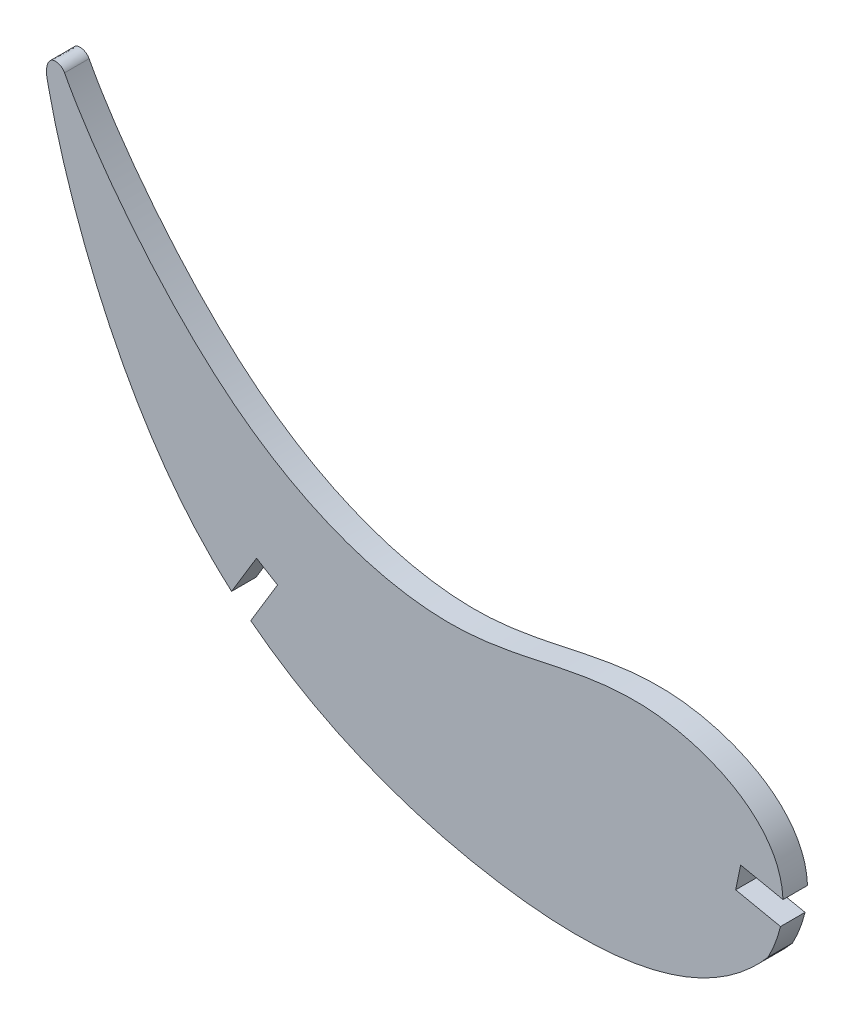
ISO-10303-21;
HEADER;
FILE_DESCRIPTION(('STEP AP214'),'2;1');
FILE_NAME('part.step','',(''),(''),'','','');
FILE_SCHEMA(('AUTOMOTIVE_DESIGN { 1 0 10303 214 1 1 1 1 }'));
ENDSEC;
DATA;
#1=APPLICATION_CONTEXT('core data for automotive mechanical design processes');
#2=APPLICATION_PROTOCOL_DEFINITION('international standard','automotive_design',2000,#1);
#3=PRODUCT_CONTEXT('',#1,'mechanical');
#4=PRODUCT('Part','Part','',(#3));
#5=PRODUCT_RELATED_PRODUCT_CATEGORY('part','',(#4));
#6=PRODUCT_DEFINITION_FORMATION('','',#4);
#7=PRODUCT_DEFINITION_CONTEXT('part definition',#1,'design');
#8=PRODUCT_DEFINITION('design','',#6,#7);
#9=PRODUCT_DEFINITION_SHAPE('','',#8);
#10=(LENGTH_UNIT() NAMED_UNIT(*) SI_UNIT(.MILLI.,.METRE.));
#11=(NAMED_UNIT(*) PLANE_ANGLE_UNIT() SI_UNIT($,.RADIAN.));
#12=(NAMED_UNIT(*) SI_UNIT($,.STERADIAN.) SOLID_ANGLE_UNIT());
#13=UNCERTAINTY_MEASURE_WITH_UNIT(LENGTH_MEASURE(1.E-05),#10,'distance_accuracy_value','');
#14=(GEOMETRIC_REPRESENTATION_CONTEXT(3) GLOBAL_UNCERTAINTY_ASSIGNED_CONTEXT((#13)) GLOBAL_UNIT_ASSIGNED_CONTEXT((#10,
#11,#12)) REPRESENTATION_CONTEXT('',''));
#15=CARTESIAN_POINT('',(0.,0.,0.));
#16=DIRECTION('',(0.,0.,1.));
#17=DIRECTION('',(1.,0.,0.));
#18=AXIS2_PLACEMENT_3D('',#15,#16,#17);
#19=CARTESIAN_POINT('',(-35.7383623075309,6.16804112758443,1.5875));
#20=DIRECTION('',(0.517983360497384,0.855390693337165,0.));
#21=DIRECTION('',(-0.855390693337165,0.517983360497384,0.));
#22=AXIS2_PLACEMENT_3D('',#19,#20,#21);
#23=PLANE('',#22);
#24=DIRECTION('',(0.855390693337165,-0.517983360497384,0.));
#25=VECTOR('',#24,1.);
#26=CARTESIAN_POINT('',(-35.7383623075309,6.16804112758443,-1.5875));
#27=LINE('',#26,#25);
#28=CARTESIAN_POINT('',(-35.7383623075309,6.16804112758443,-1.5875));
#29=VERTEX_POINT('',#28);
#30=CARTESIAN_POINT('',(-33.0224974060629,4.52344429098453,-1.5875));
#31=VERTEX_POINT('',#30);
#32=EDGE_CURVE('E219',#29,#31,#27,.T.);
#33=ORIENTED_EDGE('',*,*,#32,.T.);
#34=DIRECTION('',(0.,0.,-1.));
#35=VECTOR('',#34,1.);
#36=CARTESIAN_POINT('',(-33.0224974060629,4.52344429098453,1.5875));
#37=LINE('',#36,#35);
#38=CARTESIAN_POINT('',(-33.0224974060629,4.52344429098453,1.5875));
#39=VERTEX_POINT('',#38);
#40=EDGE_CURVE('E11',#39,#31,#37,.T.);
#41=ORIENTED_EDGE('',*,*,#40,.F.);
#42=DIRECTION('',(0.855390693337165,-0.517983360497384,0.));
#43=VECTOR('',#42,1.);
#44=CARTESIAN_POINT('',(-35.7383623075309,6.16804112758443,1.5875));
#45=LINE('',#44,#43);
#46=CARTESIAN_POINT('',(-35.7383623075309,6.16804112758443,1.5875));
#47=VERTEX_POINT('',#46);
#48=EDGE_CURVE('E267',#47,#39,#45,.T.);
#49=ORIENTED_EDGE('',*,*,#48,.F.);
#50=DIRECTION('',(0.,0.,-1.));
#51=VECTOR('',#50,1.);
#52=CARTESIAN_POINT('',(-35.7383623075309,6.16804112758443,1.5875));
#53=LINE('',#52,#51);
#54=EDGE_CURVE('E141',#47,#29,#53,.T.);
#55=ORIENTED_EDGE('',*,*,#54,.T.);
#56=EDGE_LOOP('',(#33,#41,#49,#55));
#57=FACE_BOUND('',#56,.T.);
#58=ADVANCED_FACE('F31',(#57),#23,.F.);
#59=CARTESIAN_POINT('',(-33.0224974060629,4.52344429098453,1.5875));
#60=DIRECTION('',(0.855390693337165,-0.517983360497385,0.));
#61=DIRECTION('',(0.517983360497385,0.855390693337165,0.));
#62=AXIS2_PLACEMENT_3D('',#59,#60,#61);
#63=PLANE('',#62);
#64=DIRECTION('',(-0.517983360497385,-0.855390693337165,0.));
#65=VECTOR('',#64,1.);
#66=CARTESIAN_POINT('',(-33.0224974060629,4.52344429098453,-1.5875));
#67=LINE('',#66,#65);
#68=CARTESIAN_POINT('',(-36.4917249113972,-1.20559093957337,-1.5875));
#69=VERTEX_POINT('',#68);
#70=EDGE_CURVE('E210',#31,#69,#67,.T.);
#71=ORIENTED_EDGE('',*,*,#70,.T.);
#72=DIRECTION('',(0.,0.,-1.));
#73=VECTOR('',#72,1.);
#74=CARTESIAN_POINT('',(-36.4917249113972,-1.20559093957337,1.5875));
#75=LINE('',#74,#73);
#76=CARTESIAN_POINT('',(-36.4917249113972,-1.20559093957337,1.5875));
#77=VERTEX_POINT('',#76);
#78=EDGE_CURVE('E39',#77,#69,#75,.T.);
#79=ORIENTED_EDGE('',*,*,#78,.F.);
#80=DIRECTION('',(-0.517983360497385,-0.855390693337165,0.));
#81=VECTOR('',#80,1.);
#82=CARTESIAN_POINT('',(-33.0224974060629,4.52344429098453,1.5875));
#83=LINE('',#82,#81);
#84=EDGE_CURVE('E99',#39,#77,#83,.T.);
#85=ORIENTED_EDGE('',*,*,#84,.F.);
#86=ORIENTED_EDGE('',*,*,#40,.T.);
#87=EDGE_LOOP('',(#71,#79,#85,#86));
#88=FACE_BOUND('',#87,.T.);
#89=ADVANCED_FACE('F202',(#88),#63,.F.);
#90=CARTESIAN_POINT('',(-36.4917249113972,-1.20559093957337,1.5875));
#91=CARTESIAN_POINT('',(-26.6748991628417,-8.85773970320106,1.5875));
#92=CARTESIAN_POINT('',(0.160896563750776,-18.099053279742,1.5875));
#93=CARTESIAN_POINT('',(22.4883842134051,-14.7973970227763,1.5875));
#94=CARTESIAN_POINT('',(30.4569142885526,-5.46608523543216,1.5875));
#95=B_SPLINE_CURVE_WITH_KNOTS('',3,(#90,#91,#92,#93,#94),.UNSPECIFIED.,.F.,.F.,(4,1,4),
(27.4766594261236,28.2773447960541,29.2773447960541),.UNSPECIFIED.);
#96=DIRECTION('',(0.,0.,-1.));
#97=VECTOR('',#96,1.);
#98=SURFACE_OF_LINEAR_EXTRUSION('',#95,#97);
#99=CARTESIAN_POINT('',(-36.4917249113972,-1.20559093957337,-1.5875));
#100=CARTESIAN_POINT('',(-26.6748991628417,-8.85773970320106,-1.5875));
#101=CARTESIAN_POINT('',(0.160896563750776,-18.099053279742,-1.5875));
#102=CARTESIAN_POINT('',(22.4883842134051,-14.7973970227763,-1.5875));
#103=CARTESIAN_POINT('',(30.4569142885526,-5.46608523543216,-1.5875));
#104=B_SPLINE_CURVE_WITH_KNOTS('',3,(#99,#100,#101,#102,#103),.UNSPECIFIED.,.F.,.F.,(4,1,4),
(27.4766594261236,28.2773447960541,29.2773447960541),.UNSPECIFIED.);
#105=CARTESIAN_POINT('',(30.4569142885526,-5.46608523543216,-1.5875));
#106=VERTEX_POINT('',#105);
#107=EDGE_CURVE('E218',#69,#106,#104,.T.);
#108=ORIENTED_EDGE('',*,*,#107,.T.);
#109=DIRECTION('',(0.,0.,-1.));
#110=VECTOR('',#109,1.);
#111=CARTESIAN_POINT('',(30.4569142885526,-5.46608523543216,1.5875));
#112=LINE('',#111,#110);
#113=CARTESIAN_POINT('',(30.4569142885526,-5.46608523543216,1.5875));
#114=VERTEX_POINT('',#113);
#115=EDGE_CURVE('E223',#114,#106,#112,.T.);
#116=ORIENTED_EDGE('',*,*,#115,.F.);
#117=EDGE_CURVE('E185',#77,#114,#95,.T.);
#118=ORIENTED_EDGE('',*,*,#117,.F.);
#119=ORIENTED_EDGE('',*,*,#78,.T.);
#120=EDGE_LOOP('',(#108,#116,#118,#119));
#121=FACE_BOUND('',#120,.T.);
#122=ADVANCED_FACE('F198',(#121),#98,.F.);
#123=CARTESIAN_POINT('',(14.6024043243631,3.02103963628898,1.5875));
#124=DIRECTION('',(0.,0.,-1.));
#125=DIRECTION('',(-1.,0.,0.));
#126=AXIS2_PLACEMENT_3D('',#123,#124,#125);
#127=CYLINDRICAL_SURFACE('',#126,17.9832359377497);
#128=CARTESIAN_POINT('',(30.4569142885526,-5.46608523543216,-1.5875));
#129=CARTESIAN_POINT('',(31.5416731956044,-3.43968393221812,-1.5875));
#130=CARTESIAN_POINT('',(32.0818885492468,-1.20559093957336,-1.5875));
#131=(BOUNDED_CURVE() B_SPLINE_CURVE(2,(#128,#129,#130),.UNSPECIFIED.,.F.,
.F.) B_SPLINE_CURVE_WITH_KNOTS((3,3),(0.,0.180006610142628),
.UNSPECIFIED.) CURVE() GEOMETRIC_REPRESENTATION_ITEM() RATIONAL_B_SPLINE_CURVE((1.,
0.991930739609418,1.)) REPRESENTATION_ITEM(''));
#132=CARTESIAN_POINT('',(32.0818885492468,-1.20559093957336,-1.5875));
#133=VERTEX_POINT('',#132);
#134=EDGE_CURVE('E227',#106,#133,#131,.T.);
#135=ORIENTED_EDGE('',*,*,#134,.T.);
#136=DIRECTION('',(0.,0.,-1.));
#137=VECTOR('',#136,1.);
#138=CARTESIAN_POINT('',(32.0818885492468,-1.20559093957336,1.5875));
#139=LINE('',#138,#137);
#140=CARTESIAN_POINT('',(32.0818885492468,-1.20559093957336,1.5875));
#141=VERTEX_POINT('',#140);
#142=EDGE_CURVE('E280',#141,#133,#139,.T.);
#143=ORIENTED_EDGE('',*,*,#142,.F.);
#144=CARTESIAN_POINT('',(30.4569142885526,-5.46608523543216,1.5875));
#145=CARTESIAN_POINT('',(31.5416731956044,-3.43968393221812,1.5875));
#146=CARTESIAN_POINT('',(32.0818885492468,-1.20559093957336,1.5875));
#147=(BOUNDED_CURVE() B_SPLINE_CURVE(2,(#144,#145,#146),.UNSPECIFIED.,.F.,
.F.) B_SPLINE_CURVE_WITH_KNOTS((3,3),(0.,0.180006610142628),
.UNSPECIFIED.) CURVE() GEOMETRIC_REPRESENTATION_ITEM() RATIONAL_B_SPLINE_CURVE((1.,
0.991930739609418,1.)) REPRESENTATION_ITEM(''));
#148=EDGE_CURVE('E181',#114,#141,#147,.T.);
#149=ORIENTED_EDGE('',*,*,#148,.F.);
#150=ORIENTED_EDGE('',*,*,#115,.T.);
#151=EDGE_LOOP('',(#135,#143,#149,#150));
#152=FACE_BOUND('',#151,.T.);
#153=ADVANCED_FACE('F201',(#152),#127,.T.);
#154=CARTESIAN_POINT('',(32.0818885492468,-1.20559093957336,1.5875));
#155=DIRECTION('',(-0.203228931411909,-0.979131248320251,0.));
#156=DIRECTION('',(0.979131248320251,-0.203228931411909,0.));
#157=AXIS2_PLACEMENT_3D('',#154,#155,#156);
#158=PLANE('',#157);
#159=DIRECTION('',(-0.979131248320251,0.203228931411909,0.));
#160=VECTOR('',#159,1.);
#161=CARTESIAN_POINT('',(32.0818885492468,-1.20559093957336,-1.5875));
#162=LINE('',#161,#160);
#163=CARTESIAN_POINT('',(26.2735038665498,5.17456208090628E-08,-1.5875));
#164=VERTEX_POINT('',#163);
#165=EDGE_CURVE('E229',#133,#164,#162,.T.);
#166=ORIENTED_EDGE('',*,*,#165,.T.);
#167=DIRECTION('',(0.,0.,-1.));
#168=VECTOR('',#167,1.);
#169=CARTESIAN_POINT('',(26.2735038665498,5.17456208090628E-08,1.5875));
#170=LINE('',#169,#168);
#171=CARTESIAN_POINT('',(26.2735038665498,5.17456208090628E-08,1.5875));
#172=VERTEX_POINT('',#171);
#173=EDGE_CURVE('E277',#172,#164,#170,.T.);
#174=ORIENTED_EDGE('',*,*,#173,.F.);
#175=DIRECTION('',(-0.979131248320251,0.203228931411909,0.));
#176=VECTOR('',#175,1.);
#177=CARTESIAN_POINT('',(32.0818885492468,-1.20559093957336,1.5875));
#178=LINE('',#177,#176);
#179=EDGE_CURVE('E179',#141,#172,#178,.T.);
#180=ORIENTED_EDGE('',*,*,#179,.F.);
#181=ORIENTED_EDGE('',*,*,#142,.T.);
#182=EDGE_LOOP('',(#166,#174,#180,#181));
#183=FACE_BOUND('',#182,.T.);
#184=ADVANCED_FACE('F300',(#183),#158,.F.);
#185=CARTESIAN_POINT('',(26.9187557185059,3.1087417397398,1.5875));
#186=DIRECTION('',(-0.979131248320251,0.203228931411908,0.));
#187=DIRECTION('',(-0.203228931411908,-0.979131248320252,0.));
#188=AXIS2_PLACEMENT_3D('',#185,#186,#187);
#189=PLANE('',#188);
#190=DIRECTION('',(0.203228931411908,0.979131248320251,0.));
#191=VECTOR('',#190,1.);
#192=CARTESIAN_POINT('',(26.9187557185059,3.1087417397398,-1.5875));
#193=LINE('',#192,#191);
#194=CARTESIAN_POINT('',(26.9187557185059,3.1087417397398,-1.5875));
#195=VERTEX_POINT('',#194);
#196=EDGE_CURVE('E243',#164,#195,#193,.T.);
#197=ORIENTED_EDGE('',*,*,#196,.T.);
#198=DIRECTION('',(0.,0.,-1.));
#199=VECTOR('',#198,1.);
#200=CARTESIAN_POINT('',(26.9187557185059,3.1087417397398,1.5875));
#201=LINE('',#200,#199);
#202=CARTESIAN_POINT('',(26.9187557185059,3.1087417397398,1.5875));
#203=VERTEX_POINT('',#202);
#204=EDGE_CURVE('E274',#203,#195,#201,.T.);
#205=ORIENTED_EDGE('',*,*,#204,.F.);
#206=DIRECTION('',(0.203228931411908,0.979131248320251,0.));
#207=VECTOR('',#206,1.);
#208=CARTESIAN_POINT('',(26.9187557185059,3.1087417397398,1.5875));
#209=LINE('',#208,#207);
#210=EDGE_CURVE('E177',#172,#203,#209,.T.);
#211=ORIENTED_EDGE('',*,*,#210,.F.);
#212=ORIENTED_EDGE('',*,*,#173,.T.);
#213=EDGE_LOOP('',(#197,#205,#211,#212));
#214=FACE_BOUND('',#213,.T.);
#215=ADVANCED_FACE('F298',(#214),#189,.F.);
#216=CARTESIAN_POINT('',(26.9187557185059,3.1087417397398,1.5875));
#217=DIRECTION('',(0.203228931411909,0.979131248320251,0.));
#218=DIRECTION('',(-0.979131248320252,0.203228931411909,0.));
#219=AXIS2_PLACEMENT_3D('',#216,#217,#218);
#220=PLANE('',#219);
#221=DIRECTION('',(0.979131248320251,-0.203228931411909,0.));
#222=VECTOR('',#221,1.);
#223=CARTESIAN_POINT('',(26.9187557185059,3.1087417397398,-1.5875));
#224=LINE('',#223,#222);
#225=CARTESIAN_POINT('',(32.4028417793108,1.9704623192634,-1.5875));
#226=VERTEX_POINT('',#225);
#227=EDGE_CURVE('E245',#195,#226,#224,.T.);
#228=ORIENTED_EDGE('',*,*,#227,.T.);
#229=DIRECTION('',(0.,0.,-1.));
#230=VECTOR('',#229,1.);
#231=CARTESIAN_POINT('',(32.4028417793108,1.9704623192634,1.5875));
#232=LINE('',#231,#230);
#233=CARTESIAN_POINT('',(32.4028417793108,1.9704623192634,1.5875));
#234=VERTEX_POINT('',#233);
#235=EDGE_CURVE('E271',#234,#226,#232,.T.);
#236=ORIENTED_EDGE('',*,*,#235,.F.);
#237=DIRECTION('',(0.979131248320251,-0.203228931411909,0.));
#238=VECTOR('',#237,1.);
#239=CARTESIAN_POINT('',(26.9187557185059,3.1087417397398,1.5875));
#240=LINE('',#239,#238);
#241=EDGE_CURVE('E172',#203,#234,#240,.T.);
#242=ORIENTED_EDGE('',*,*,#241,.F.);
#243=ORIENTED_EDGE('',*,*,#204,.T.);
#244=EDGE_LOOP('',(#228,#236,#242,#243));
#245=FACE_BOUND('',#244,.T.);
#246=ADVANCED_FACE('F165',(#245),#220,.F.);
#247=CARTESIAN_POINT('',(32.4028417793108,1.9704623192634,1.5875));
#248=CARTESIAN_POINT('',(32.1175196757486,9.52456004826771,1.5875));
#249=CARTESIAN_POINT('',(13.3476073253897,18.7403575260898,1.5875));
#250=CARTESIAN_POINT('',(-8.37824700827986,7.67889214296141,1.5875));
#251=CARTESIAN_POINT('',(-39.8515423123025,17.9852589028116,1.5875));
#252=CARTESIAN_POINT('',(-57.2687463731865,41.7687102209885,1.5875));
#253=CARTESIAN_POINT('',(-60.5863517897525,48.1505856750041,1.5875));
#254=B_SPLINE_CURVE_WITH_KNOTS('',3,(#247,#248,#249,#250,#251,#252,#253),.UNSPECIFIED.,.F.,.F.,
(4,1,1,1,4),(23.,23.7759370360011,24.7759370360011,25.7759370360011,26.7759370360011),.UNSPECIFIED.);
#255=DIRECTION('',(0.,0.,-1.));
#256=VECTOR('',#255,1.);
#257=SURFACE_OF_LINEAR_EXTRUSION('',#254,#256);
#258=CARTESIAN_POINT('',(32.4028417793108,1.9704623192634,-1.5875));
#259=CARTESIAN_POINT('',(32.1175196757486,9.52456004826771,-1.5875));
#260=CARTESIAN_POINT('',(13.3476073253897,18.7403575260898,-1.5875));
#261=CARTESIAN_POINT('',(-8.37824700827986,7.67889214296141,-1.5875));
#262=CARTESIAN_POINT('',(-39.8515423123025,17.9852589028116,-1.5875));
#263=CARTESIAN_POINT('',(-57.2687463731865,41.7687102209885,-1.5875));
#264=CARTESIAN_POINT('',(-60.5863517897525,48.1505856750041,-1.5875));
#265=B_SPLINE_CURVE_WITH_KNOTS('',3,(#258,#259,#260,#261,#262,#263,#264),.UNSPECIFIED.,.F.,.F.,
(4,1,1,1,4),(23.,23.7759370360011,24.7759370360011,25.7759370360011,26.7759370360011),.UNSPECIFIED.);
#266=CARTESIAN_POINT('',(-60.5863517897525,48.1505856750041,-1.5875));
#267=VERTEX_POINT('',#266);
#268=EDGE_CURVE('E247',#226,#267,#265,.T.);
#269=ORIENTED_EDGE('',*,*,#268,.T.);
#270=DIRECTION('',(0.,0.,-1.));
#271=VECTOR('',#270,1.);
#272=CARTESIAN_POINT('',(-60.5863517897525,48.1505856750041,1.5875));
#273=LINE('',#272,#271);
#274=CARTESIAN_POINT('',(-60.5863517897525,48.1505856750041,1.5875));
#275=VERTEX_POINT('',#274);
#276=EDGE_CURVE('E136',#275,#267,#273,.T.);
#277=ORIENTED_EDGE('',*,*,#276,.F.);
#278=EDGE_CURVE('E127',#234,#275,#254,.T.);
#279=ORIENTED_EDGE('',*,*,#278,.F.);
#280=ORIENTED_EDGE('',*,*,#235,.T.);
#281=EDGE_LOOP('',(#269,#277,#279,#280));
#282=FACE_BOUND('',#281,.T.);
#283=ADVANCED_FACE('F162',(#282),#257,.F.);
#284=CARTESIAN_POINT('',(-60.5863517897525,48.1505856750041,1.5875));
#285=CARTESIAN_POINT('',(-60.8617737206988,48.7162486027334,1.5875));
#286=CARTESIAN_POINT('',(-62.4201236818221,49.2505493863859,1.5875));
#287=CARTESIAN_POINT('',(-63.1325173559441,47.2647840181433,1.5875));
#288=CARTESIAN_POINT('',(-62.7776107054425,46.0646447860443,1.5875));
#289=CARTESIAN_POINT('',(-62.655783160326,45.4575030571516,1.5875));
#290=B_SPLINE_CURVE_WITH_KNOTS('',3,(#284,#285,#286,#287,#288,#289),.UNSPECIFIED.,.F.,.F.,(4,1,
1,4),(20.,21.,22.,23.),.UNSPECIFIED.);
#291=DIRECTION('',(0.,0.,-1.));
#292=VECTOR('',#291,1.);
#293=SURFACE_OF_LINEAR_EXTRUSION('',#290,#292);
#294=CARTESIAN_POINT('',(-60.5863517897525,48.1505856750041,-1.5875));
#295=CARTESIAN_POINT('',(-60.8617737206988,48.7162486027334,-1.5875));
#296=CARTESIAN_POINT('',(-62.4201236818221,49.2505493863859,-1.5875));
#297=CARTESIAN_POINT('',(-63.1325173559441,47.2647840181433,-1.5875));
#298=CARTESIAN_POINT('',(-62.7776107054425,46.0646447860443,-1.5875));
#299=CARTESIAN_POINT('',(-62.655783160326,45.4575030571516,-1.5875));
#300=B_SPLINE_CURVE_WITH_KNOTS('',3,(#294,#295,#296,#297,#298,#299),.UNSPECIFIED.,.F.,.F.,(4,1,
1,4),(20.,21.,22.,23.),.UNSPECIFIED.);
#301=CARTESIAN_POINT('',(-62.655783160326,45.4575030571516,-1.5875));
#302=VERTEX_POINT('',#301);
#303=EDGE_CURVE('E135',#267,#302,#300,.T.);
#304=ORIENTED_EDGE('',*,*,#303,.T.);
#305=DIRECTION('',(0.,0.,-1.));
#306=VECTOR('',#305,1.);
#307=CARTESIAN_POINT('',(-62.655783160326,45.4575030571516,1.5875));
#308=LINE('',#307,#306);
#309=CARTESIAN_POINT('',(-62.655783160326,45.4575030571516,1.5875));
#310=VERTEX_POINT('',#309);
#311=EDGE_CURVE('E132',#310,#302,#308,.T.);
#312=ORIENTED_EDGE('',*,*,#311,.F.);
#313=EDGE_CURVE('E121',#275,#310,#290,.T.);
#314=ORIENTED_EDGE('',*,*,#313,.F.);
#315=ORIENTED_EDGE('',*,*,#276,.T.);
#316=EDGE_LOOP('',(#304,#312,#314,#315));
#317=FACE_BOUND('',#316,.T.);
#318=ADVANCED_FACE('F133',(#317),#293,.F.);
#319=CARTESIAN_POINT('',(-62.655783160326,45.4575030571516,1.5875));
#320=CARTESIAN_POINT('',(-60.3393679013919,34.8075706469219,1.5875));
#321=CARTESIAN_POINT('',(-53.2788855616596,14.7013968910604,1.5875));
#322=CARTESIAN_POINT('',(-40.5056057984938,2.18887908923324,1.5875));
#323=CARTESIAN_POINT('',(-38.9653807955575,0.838986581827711,1.5875));
#324=B_SPLINE_CURVE_WITH_KNOTS('',3,(#319,#320,#321,#322,#323),.UNSPECIFIED.,.F.,.F.,(4,1,4),
(18.8692549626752,19.8692549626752,20.),.UNSPECIFIED.);
#325=DIRECTION('',(0.,0.,-1.));
#326=VECTOR('',#325,1.);
#327=SURFACE_OF_LINEAR_EXTRUSION('',#324,#326);
#328=CARTESIAN_POINT('',(-62.655783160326,45.4575030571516,-1.5875));
#329=CARTESIAN_POINT('',(-60.3393679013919,34.8075706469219,-1.5875));
#330=CARTESIAN_POINT('',(-53.2788855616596,14.7013968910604,-1.5875));
#331=CARTESIAN_POINT('',(-40.5056057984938,2.18887908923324,-1.5875));
#332=CARTESIAN_POINT('',(-38.9653807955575,0.838986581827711,-1.5875));
#333=B_SPLINE_CURVE_WITH_KNOTS('',3,(#328,#329,#330,#331,#332),.UNSPECIFIED.,.F.,.F.,(4,1,4),
(18.8692549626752,19.8692549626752,20.),.UNSPECIFIED.);
#334=CARTESIAN_POINT('',(-38.9653807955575,0.838986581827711,-1.5875));
#335=VERTEX_POINT('',#334);
#336=EDGE_CURVE('E85',#302,#335,#333,.T.);
#337=ORIENTED_EDGE('',*,*,#336,.T.);
#338=DIRECTION('',(0.,0.,-1.));
#339=VECTOR('',#338,1.);
#340=CARTESIAN_POINT('',(-38.9653807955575,0.838986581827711,1.5875));
#341=LINE('',#340,#339);
#342=CARTESIAN_POINT('',(-38.9653807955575,0.838986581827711,1.5875));
#343=VERTEX_POINT('',#342);
#344=EDGE_CURVE('E137',#343,#335,#341,.T.);
#345=ORIENTED_EDGE('',*,*,#344,.F.);
#346=EDGE_CURVE('E125',#310,#343,#324,.T.);
#347=ORIENTED_EDGE('',*,*,#346,.F.);
#348=ORIENTED_EDGE('',*,*,#311,.T.);
#349=EDGE_LOOP('',(#337,#345,#347,#348));
#350=FACE_BOUND('',#349,.T.);
#351=ADVANCED_FACE('F139',(#350),#327,.F.);
#352=CARTESIAN_POINT('',(-35.7383623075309,6.16804112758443,1.5875));
#353=DIRECTION('',(-0.855390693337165,0.517983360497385,0.));
#354=DIRECTION('',(-0.517983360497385,-0.855390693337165,0.));
#355=AXIS2_PLACEMENT_3D('',#352,#353,#354);
#356=PLANE('',#355);
#357=DIRECTION('',(0.517983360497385,0.855390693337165,0.));
#358=VECTOR('',#357,1.);
#359=CARTESIAN_POINT('',(-35.7383623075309,6.16804112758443,-1.5875));
#360=LINE('',#359,#358);
#361=EDGE_CURVE('E91',#335,#29,#360,.T.);
#362=ORIENTED_EDGE('',*,*,#361,.T.);
#363=ORIENTED_EDGE('',*,*,#54,.F.);
#364=DIRECTION('',(0.517983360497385,0.855390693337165,0.));
#365=VECTOR('',#364,1.);
#366=CARTESIAN_POINT('',(-35.7383623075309,6.16804112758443,1.5875));
#367=LINE('',#366,#365);
#368=EDGE_CURVE('E47',#343,#47,#367,.T.);
#369=ORIENTED_EDGE('',*,*,#368,.F.);
#370=ORIENTED_EDGE('',*,*,#344,.T.);
#371=EDGE_LOOP('',(#362,#363,#369,#370));
#372=FACE_BOUND('',#371,.T.);
#373=ADVANCED_FACE('F158',(#372),#356,.F.);
#374=CARTESIAN_POINT('',(0.377450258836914,-15.0856623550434,1.5875));
#375=DIRECTION('',(0.,0.,1.));
#376=DIRECTION('',(1.,0.,0.));
#377=AXIS2_PLACEMENT_3D('',#374,#375,#376);
#378=PLANE('',#377);
#379=ORIENTED_EDGE('',*,*,#48,.T.);
#380=ORIENTED_EDGE('',*,*,#84,.T.);
#381=ORIENTED_EDGE('',*,*,#117,.T.);
#382=ORIENTED_EDGE('',*,*,#148,.T.);
#383=ORIENTED_EDGE('',*,*,#179,.T.);
#384=ORIENTED_EDGE('',*,*,#210,.T.);
#385=ORIENTED_EDGE('',*,*,#241,.T.);
#386=ORIENTED_EDGE('',*,*,#278,.T.);
#387=ORIENTED_EDGE('',*,*,#313,.T.);
#388=ORIENTED_EDGE('',*,*,#346,.T.);
#389=ORIENTED_EDGE('',*,*,#368,.T.);
#390=EDGE_LOOP('',(#379,#380,#381,#382,#383,#384,#385,#386,#387,#388,#389));
#391=FACE_BOUND('',#390,.T.);
#392=ADVANCED_FACE('F123',(#391),#378,.T.);
#393=CARTESIAN_POINT('',(0.377450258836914,-15.0856623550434,-1.5875));
#394=DIRECTION('',(0.,0.,1.));
#395=DIRECTION('',(1.,0.,0.));
#396=AXIS2_PLACEMENT_3D('',#393,#394,#395);
#397=PLANE('',#396);
#398=ORIENTED_EDGE('',*,*,#32,.F.);
#399=ORIENTED_EDGE('',*,*,#361,.F.);
#400=ORIENTED_EDGE('',*,*,#336,.F.);
#401=ORIENTED_EDGE('',*,*,#303,.F.);
#402=ORIENTED_EDGE('',*,*,#268,.F.);
#403=ORIENTED_EDGE('',*,*,#227,.F.);
#404=ORIENTED_EDGE('',*,*,#196,.F.);
#405=ORIENTED_EDGE('',*,*,#165,.F.);
#406=ORIENTED_EDGE('',*,*,#134,.F.);
#407=ORIENTED_EDGE('',*,*,#107,.F.);
#408=ORIENTED_EDGE('',*,*,#70,.F.);
#409=EDGE_LOOP('',(#398,#399,#400,#401,#402,#403,#404,#405,#406,#407,#408));
#410=FACE_BOUND('',#409,.T.);
#411=ADVANCED_FACE('F225',(#410),#397,.F.);
#412=CLOSED_SHELL('',(#58,#89,#122,#153,#184,#215,#246,#283,#318,#351,#373,#392,#411));
#413=MANIFOLD_SOLID_BREP('B2',#412);
#414=ADVANCED_BREP_SHAPE_REPRESENTATION('',(#18,#413),#14);
#415=SHAPE_DEFINITION_REPRESENTATION(#9,#414);
ENDSEC;
END-ISO-10303-21;
